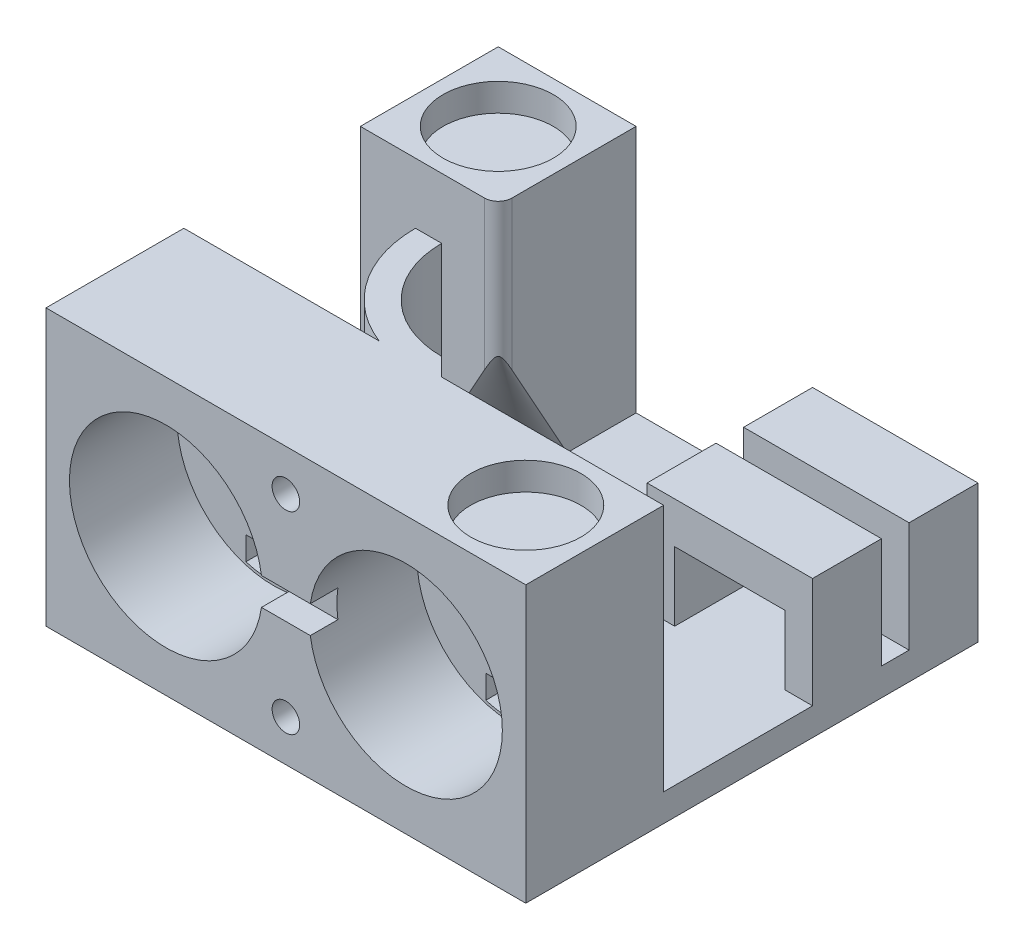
from build123d import *

# Parameters (mm, degrees)
SKETCH1_W               = 17.4
SKETCH1_H               = 17.4
BOSS_EXTRUDE1_DEPTH     = 1
SKETCH4_W               = 17.4
SKETCH4_H               = 9
BOSS_EXTRUDE3_DEPTH     = 6
CUT_EXTRUDE3_DEPTH      = 22.873499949
CUT_EXTRUDE3_DEPTH_BACK = 22.873499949
SKETCH7_W               = 1
SKETCH7_H               = 10
SKETCH11_R              = 3.5
CUT_EXTRUDE7_DEPTH      = 3.9
CUT_EXTRUDE8_REACH      = 23.087
SKETCH14_W              = 1.77179677
SKETCH14_H              = 1
CUT_EXTRUDE9_DEPTH      = 1
CUT_EXTRUDE11_REACH     = 23.087
SKETCH15_R              = 0.5
CUT_EXTRUDE12_REACH     = 17.244
SKETCH16_R              = 2.9
SKETCH17_W              = 5
SKETCH17_H              = 5
BOSS_EXTRUDE4_DEPTH     = 9
CUT_REVOLVE1_ANGLE      = 90
FILLET1_R               = 0.5
SKETCH20_W              = 6.000401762
SKETCH20_H              = 6
BOSS_EXTRUDE5_DEPTH     = 9
CUT_EXTRUDE13_REACH     = 23.873
SKETCH21_W              = 6
SKETCH21_H              = 5
SKETCH22_W              = 6.000401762
SKETCH22_H              = 1
CUT_EXTRUDE14_DEPTH     = 4
CUT_EXTRUDE15_REACH     = 23.087
SKETCH23_W              = 4.000401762
SKETCH23_H              = 2.5
BOSS_EXTRUDE6_DEPTH     = 9
SKETCH25_R              = 2
CUT_EXTRUDE16_DEPTH     = 1


with BuildPart() as part:
    # Sketch1 → Boss-Extrude1 (new body)
    with BuildSketch(Plane(origin=(0, 0, 0), x_dir=(1, 0, 0), z_dir=(0, 1, 0))):
        Rectangle(SKETCH1_W, SKETCH1_H)
    extrude(amount=BOSS_EXTRUDE1_DEPTH)

    # Sketch4 → Boss-Extrude3 (add)
    with BuildSketch(Plane.XY.offset(8.7)):
        with Locations((0, 5.5)):
            Rectangle(SKETCH4_W, SKETCH4_H)
    extrude(amount=-BOSS_EXTRUDE3_DEPTH)

    # Sketch7 → Cut-Extrude3 (cut, two sides: drawn at the far end of the back side and taken through both)
    with BuildSketch(Plane(origin=(8.7, 0, 0), x_dir=(0, 0, -1), z_dir=(1, 0, 0)).offset(-CUT_EXTRUDE3_DEPTH_BACK)):
        with Locations((-8.2, 5)):
            Rectangle(SKETCH7_W, SKETCH7_H)
    extrude(amount=CUT_EXTRUDE3_DEPTH + CUT_EXTRUDE3_DEPTH_BACK, mode=Mode.SUBTRACT)

    # Sketch11 → Cut-Extrude7 (cut)
    with BuildSketch(Plane.XY.offset(7.7)):
        with Locations((4.35, 5)):
            Circle(SKETCH11_R)
        with Locations(Location((-4.35, 5, 0), (0, 0, 180))):
            Circle(SKETCH11_R)
    extrude(amount=-CUT_EXTRUDE7_DEPTH, mode=Mode.SUBTRACT)

    # Sketch13 → Cut-Extrude8 (cut, up to next)
    with BuildSketch(Plane.XY.offset(7.7), mode=Mode.PRIVATE) as cut_extrude8_sk1:
        with BuildLine():
            Line((5.35, 1.750384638), (5.35, 2.6))
            Line((5.35, 2.6), (3.35, 2.6))
            Line((3.35, 2.6), (3.35, 1.750384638))
            ThreePointArc((3.35, 1.750384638), (4.35, 1.6), (5.35, 1.750384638))
        make_face()
    cut_extrude8_tool1 = extrude(cut_extrude8_sk1.sketch, amount=-CUT_EXTRUDE8_REACH, mode=Mode.PRIVATE) & part.part
    # Sketch13 → Cut-Extrude8 (cut, up to next)
    with BuildSketch(Plane.XY.offset(7.7), mode=Mode.PRIVATE) as cut_extrude8_sk2:
        with BuildLine():
            Line((-5.35, 1.750384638), (-5.35, 2.6))
            Line((-5.35, 2.6), (-3.35, 2.6))
            Line((-3.35, 2.6), (-3.35, 1.750384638))
            ThreePointArc((-3.35, 1.750384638), (-4.35, 1.6), (-5.35, 1.750384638))
        make_face()
    cut_extrude8_tool2 = extrude(cut_extrude8_sk2.sketch, amount=-CUT_EXTRUDE8_REACH, mode=Mode.PRIVATE) & part.part
    add(cut_extrude8_tool1.solids().sort_by_distance((4.35, 2.123787, 7.7))[0], mode=Mode.SUBTRACT)
    add(cut_extrude8_tool2.solids().sort_by_distance((-4.35, 2.123787, 7.7))[0], mode=Mode.SUBTRACT)

    # Sketch14 → Cut-Extrude9 (cut)
    with BuildSketch(Plane.XY.offset(7.7)):
        with Locations((0, 5)):
            Rectangle(SKETCH14_W, SKETCH14_H)
    extrude(amount=-CUT_EXTRUDE9_DEPTH, mode=Mode.SUBTRACT)

    # Sketch15 → Cut-Extrude11 (cut, up to next)
    with BuildSketch(Plane.XY.offset(7.7), mode=Mode.PRIVATE) as cut_extrude11_sk1:
        with Locations((0, 8.5)):
            Circle(SKETCH15_R)
    cut_extrude11_tool1 = extrude(cut_extrude11_sk1.sketch, amount=-CUT_EXTRUDE11_REACH, mode=Mode.PRIVATE) & part.part
    # Sketch15 → Cut-Extrude11 (cut, up to next)
    with BuildSketch(Plane.XY.offset(7.7), mode=Mode.PRIVATE) as cut_extrude11_sk2:
        with Locations((0, 1.5)):
            Circle(SKETCH15_R)
    cut_extrude11_tool2 = extrude(cut_extrude11_sk2.sketch, amount=-CUT_EXTRUDE11_REACH, mode=Mode.PRIVATE) & part.part
    add(cut_extrude11_tool1.solids().sort_by_distance((0, 8.5, 7.7))[0], mode=Mode.SUBTRACT)
    add(cut_extrude11_tool2.solids().sort_by_distance((0, 1.5, 7.7))[0], mode=Mode.SUBTRACT)

    # Sketch16 → Cut-Extrude12 (cut, up to next)
    with BuildSketch(Plane(origin=(0, 1, 0), x_dir=(1, 0, 0), z_dir=(0, 1, 0)), mode=Mode.PRIVATE) as cut_extrude12_sk1:
        with Locations(Location((0, 1.5, 0), (0, 0, 270))):
            Circle(SKETCH16_R)
    cut_extrude12_tool1 = extrude(cut_extrude12_sk1.sketch, amount=-CUT_EXTRUDE12_REACH, mode=Mode.PRIVATE) & part.part
    add(cut_extrude12_tool1.solids().sort_by_distance((0, 1, -1.5))[0], mode=Mode.SUBTRACT)

    # Sketch17 → Boss-Extrude4 (add)
    with BuildSketch(Plane(origin=(0, 1, 0), x_dir=(1, 0, 0), z_dir=(0, 1, 0))):
        with Locations((-6.2, 6.2)):
            Rectangle(SKETCH17_W, SKETCH17_H)
    extrude(amount=BOSS_EXTRUDE4_DEPTH)

    # Sketch19 → Cut-Revolve1 (revolve, cut)
    with BuildSketch(Plane(origin=(-3.7, 0, 0), x_dir=(0, 0, -1), z_dir=(1, 0, 0))):
        Polygon((3.7, 5.5), (6.2, 1), (3.7, 1), align=None)
    revolve(axis=Axis((-3.7, -993.62681115, -3.7), (0, 1, 0)), revolution_arc=CUT_REVOLVE1_ANGLE, mode=Mode.SUBTRACT)

    # Fillet1
    fillet1_edges = [part.edges().sort_by_distance(p)[0] for p in [
        (-3.7, 7.75, -3.7),
    ]]
    fillet(fillet1_edges, radius=FILLET1_R)

    # Sketch20 → Boss-Extrude5 (add)
    with BuildSketch(Plane(origin=(0, 1, 0), x_dir=(1, 0, 0), z_dir=(0, 1, 0))):
        with Locations((5.699799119, 5.7)):
            Rectangle(SKETCH20_W, SKETCH20_H)
    extrude(amount=BOSS_EXTRUDE5_DEPTH)

    # Sketch21 → Cut-Extrude13 (cut, up to next)
    with BuildSketch(Plane(origin=(8.7, 0, 0), x_dir=(0, 0, -1), z_dir=(1, 0, 0)), mode=Mode.PRIVATE) as cut_extrude13_sk1:
        with Locations((5.7, 7.5)):
            Rectangle(SKETCH21_W, SKETCH21_H)
    cut_extrude13_tool1 = extrude(cut_extrude13_sk1.sketch, amount=-CUT_EXTRUDE13_REACH, mode=Mode.PRIVATE) & part.part
    add(cut_extrude13_tool1.solids().sort_by_distance((8.7, 7.5, -5.7))[0], mode=Mode.SUBTRACT)

    # Sketch22 → Cut-Extrude14 (cut)
    with BuildSketch(Plane(origin=(0, 5, 0), x_dir=(1, 0, 0), z_dir=(0, 1, 0))):
        with Locations((5.699799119, 5.7)):
            Rectangle(SKETCH22_W, SKETCH22_H)
    extrude(amount=-CUT_EXTRUDE14_DEPTH, mode=Mode.SUBTRACT)

    # Cut-Extrude15: up to this face of the body (flat: up to its plane)
    cut_extrude15_end = Plane(part.part.faces().sort_by_distance((5.699799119, 3, -2.7))[0])
    # Sketch23 → Cut-Extrude15 (cut, up to the picked face)
    with BuildSketch(Plane(origin=(0, 0, -8.7), x_dir=(-1, 0, 0), z_dir=(0, 0, -1)), mode=Mode.PRIVATE) as cut_extrude15_sk1:
        with Locations((-5.699799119, 2.25)):
            Rectangle(SKETCH23_W, SKETCH23_H)
    cut_extrude15_tool1 = split(extrude(cut_extrude15_sk1.sketch, amount=-CUT_EXTRUDE15_REACH, mode=Mode.PRIVATE), bisect_by=cut_extrude15_end, keep=Keep.BOTH, mode=Mode.PRIVATE)
    add(cut_extrude15_tool1.solids().sort_by(Axis((5.699799, 2.25, -8.7), (0, 0, 1)))[0], mode=Mode.SUBTRACT)

    # Sketch24 → Boss-Extrude6 (add)
    with BuildSketch(Plane(origin=(0, 1, 0), x_dir=(1, 0, 0), z_dir=(0, 1, 0))):
        with BuildLine():
            Line((-3.55, 1.5), (-4.5, 1.5))
            ThreePointArc((-4.5, 1.5), (-3.709445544, -1.04755054), (-1.615549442, -2.7))
            Line((-1.615549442, -2.7), (0, -2.7))
            Line((0, -2.7), (0, -2.05))
            ThreePointArc((0, -2.05), (-2.510229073, -1.010229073), (-3.55, 1.5))
        make_face()
        Polygon((0.65, -2.7), (0, -2.05), (0, -2.7), align=None)
    extrude(amount=BOSS_EXTRUDE6_DEPTH)

    # Sketch25 → Cut-Extrude16 (cut)
    with BuildSketch(Plane(origin=(0, 10, 0), x_dir=(1, 0, 0), z_dir=(0, 1, 0))):
        with Locations(Location((-6.2, 6.2, 0), (0, 0, 270))):
            Circle(SKETCH25_R)
        with Locations(Location((6.2, -5.2, 0), (0, 0, 270))):
            Circle(SKETCH25_R)
    extrude(amount=-CUT_EXTRUDE16_DEPTH, mode=Mode.SUBTRACT)


solid = part.part
